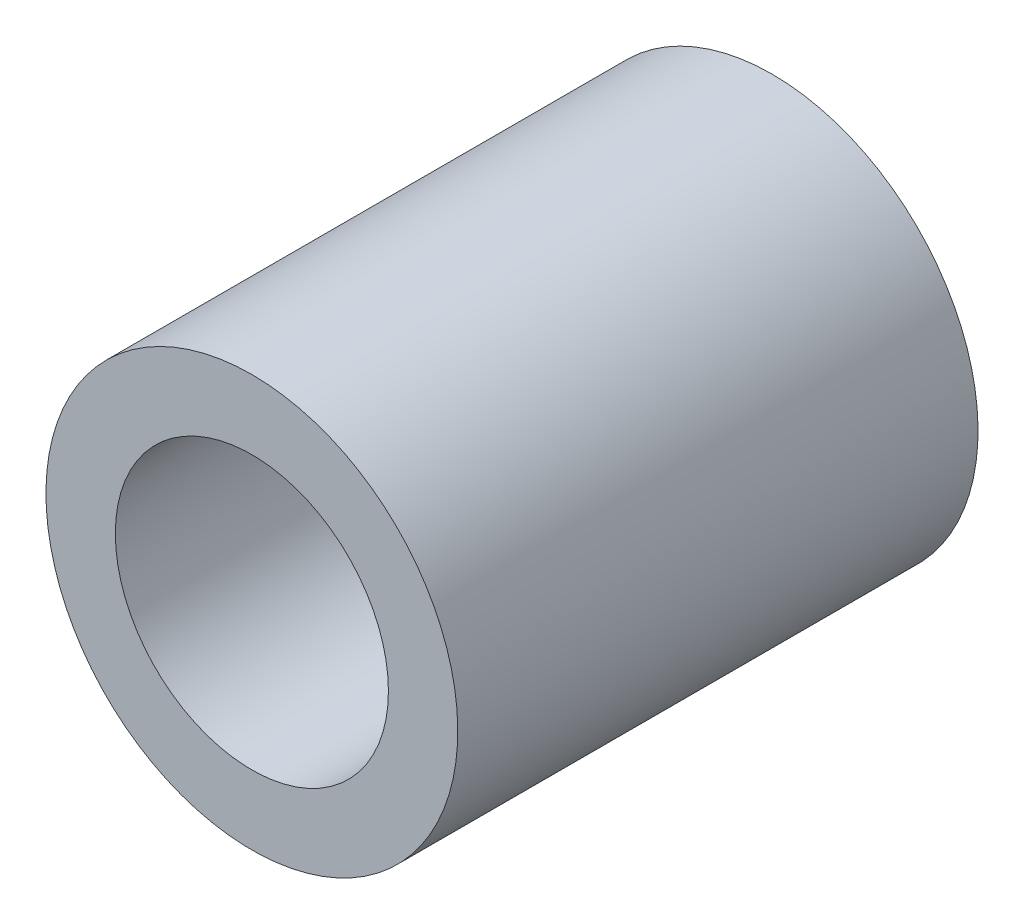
ISO-10303-21;
HEADER;
FILE_DESCRIPTION(('STEP AP214'),'2;1');
FILE_NAME('part.step','',(''),(''),'','','');
FILE_SCHEMA(('AUTOMOTIVE_DESIGN { 1 0 10303 214 1 1 1 1 }'));
ENDSEC;
DATA;
#1=APPLICATION_CONTEXT('core data for automotive mechanical design processes');
#2=APPLICATION_PROTOCOL_DEFINITION('international standard','automotive_design',2000,#1);
#3=PRODUCT_CONTEXT('',#1,'mechanical');
#4=PRODUCT('Part','Part','',(#3));
#5=PRODUCT_RELATED_PRODUCT_CATEGORY('part','',(#4));
#6=PRODUCT_DEFINITION_FORMATION('','',#4);
#7=PRODUCT_DEFINITION_CONTEXT('part definition',#1,'design');
#8=PRODUCT_DEFINITION('design','',#6,#7);
#9=PRODUCT_DEFINITION_SHAPE('','',#8);
#10=(LENGTH_UNIT() NAMED_UNIT(*) SI_UNIT(.MILLI.,.METRE.));
#11=(NAMED_UNIT(*) PLANE_ANGLE_UNIT() SI_UNIT($,.RADIAN.));
#12=(NAMED_UNIT(*) SI_UNIT($,.STERADIAN.) SOLID_ANGLE_UNIT());
#13=UNCERTAINTY_MEASURE_WITH_UNIT(LENGTH_MEASURE(1.E-05),#10,'distance_accuracy_value','');
#14=(GEOMETRIC_REPRESENTATION_CONTEXT(3) GLOBAL_UNCERTAINTY_ASSIGNED_CONTEXT((#13)) GLOBAL_UNIT_ASSIGNED_CONTEXT((#10,
#11,#12)) REPRESENTATION_CONTEXT('',''));
#15=CARTESIAN_POINT('',(0.,0.,0.));
#16=DIRECTION('',(0.,0.,1.));
#17=DIRECTION('',(1.,0.,0.));
#18=AXIS2_PLACEMENT_3D('',#15,#16,#17);
#19=CARTESIAN_POINT('',(0.,0.,9.52500000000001));
#20=DIRECTION('',(0.,0.,1.));
#21=DIRECTION('',(1.,0.,0.));
#22=AXIS2_PLACEMENT_3D('',#19,#20,#21);
#23=CYLINDRICAL_SURFACE('',#22,2.49999999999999);
#24=CARTESIAN_POINT('',(0.,0.,0.));
#25=DIRECTION('',(0.,0.,1.));
#26=DIRECTION('',(1.,0.,0.));
#27=AXIS2_PLACEMENT_3D('',#24,#25,#26);
#28=CIRCLE('',#27,2.49999999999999);
#29=CARTESIAN_POINT('',(2.49999999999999,0.,0.));
#30=VERTEX_POINT('',#29);
#31=EDGE_CURVE('E27',#30,#30,#28,.F.);
#32=ORIENTED_EDGE('',*,*,#31,.T.);
#33=EDGE_LOOP('',(#32));
#34=FACE_BOUND('',#33,.T.);
#35=CARTESIAN_POINT('',(0.,0.,9.52500000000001));
#36=DIRECTION('',(0.,0.,1.));
#37=DIRECTION('',(1.,0.,0.));
#38=AXIS2_PLACEMENT_3D('',#35,#36,#37);
#39=CIRCLE('',#38,2.49999999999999);
#40=CARTESIAN_POINT('',(2.49999999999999,0.,9.52500000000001));
#41=VERTEX_POINT('',#40);
#42=EDGE_CURVE('E18',#41,#41,#39,.F.);
#43=ORIENTED_EDGE('',*,*,#42,.F.);
#44=EDGE_LOOP('',(#43));
#45=FACE_BOUND('',#44,.T.);
#46=ADVANCED_FACE('F15',(#34,#45),#23,.F.);
#47=CARTESIAN_POINT('',(0.,0.,9.52500000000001));
#48=DIRECTION('',(0.,0.,1.));
#49=DIRECTION('',(1.,0.,0.));
#50=AXIS2_PLACEMENT_3D('',#47,#48,#49);
#51=PLANE('',#50);
#52=CARTESIAN_POINT('',(0.,0.,9.52500000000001));
#53=DIRECTION('',(0.,0.,-1.));
#54=DIRECTION('',(0.,1.,0.));
#55=AXIS2_PLACEMENT_3D('',#52,#53,#54);
#56=CIRCLE('',#55,3.76999999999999);
#57=CARTESIAN_POINT('',(0.,3.77000000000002,9.52500000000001));
#58=VERTEX_POINT('',#57);
#59=EDGE_CURVE('E22',#58,#58,#56,.T.);
#60=ORIENTED_EDGE('',*,*,#59,.F.);
#61=EDGE_LOOP('',(#60));
#62=FACE_BOUND('',#61,.T.);
#63=ORIENTED_EDGE('',*,*,#42,.T.);
#64=EDGE_LOOP('',(#63));
#65=FACE_BOUND('',#64,.T.);
#66=ADVANCED_FACE('F35',(#62,#65),#51,.T.);
#67=CARTESIAN_POINT('',(0.,0.,0.));
#68=DIRECTION('',(0.,0.,1.));
#69=DIRECTION('',(1.,0.,0.));
#70=AXIS2_PLACEMENT_3D('',#67,#68,#69);
#71=PLANE('',#70);
#72=CARTESIAN_POINT('',(0.,0.,0.));
#73=DIRECTION('',(0.,0.,-1.));
#74=DIRECTION('',(0.,1.,0.));
#75=AXIS2_PLACEMENT_3D('',#72,#73,#74);
#76=CIRCLE('',#75,3.76999999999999);
#77=CARTESIAN_POINT('',(0.,3.77000000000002,0.));
#78=VERTEX_POINT('',#77);
#79=EDGE_CURVE('E10',#78,#78,#76,.F.);
#80=ORIENTED_EDGE('',*,*,#79,.F.);
#81=EDGE_LOOP('',(#80));
#82=FACE_BOUND('',#81,.T.);
#83=ORIENTED_EDGE('',*,*,#31,.F.);
#84=EDGE_LOOP('',(#83));
#85=FACE_BOUND('',#84,.T.);
#86=ADVANCED_FACE('F42',(#82,#85),#71,.F.);
#87=CARTESIAN_POINT('',(0.,0.,9.52500000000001));
#88=DIRECTION('',(0.,0.,-1.));
#89=DIRECTION('',(0.,1.,0.));
#90=AXIS2_PLACEMENT_3D('',#87,#88,#89);
#91=CYLINDRICAL_SURFACE('',#90,3.76999999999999);
#92=ORIENTED_EDGE('',*,*,#79,.T.);
#93=EDGE_LOOP('',(#92));
#94=FACE_BOUND('',#93,.T.);
#95=ORIENTED_EDGE('',*,*,#59,.T.);
#96=EDGE_LOOP('',(#95));
#97=FACE_BOUND('',#96,.T.);
#98=ADVANCED_FACE('F44',(#94,#97),#91,.T.);
#99=CLOSED_SHELL('',(#46,#66,#86,#98));
#100=MANIFOLD_SOLID_BREP('B1',#99);
#101=ADVANCED_BREP_SHAPE_REPRESENTATION('',(#18,#100),#14);
#102=SHAPE_DEFINITION_REPRESENTATION(#9,#101);
ENDSEC;
END-ISO-10303-21;
